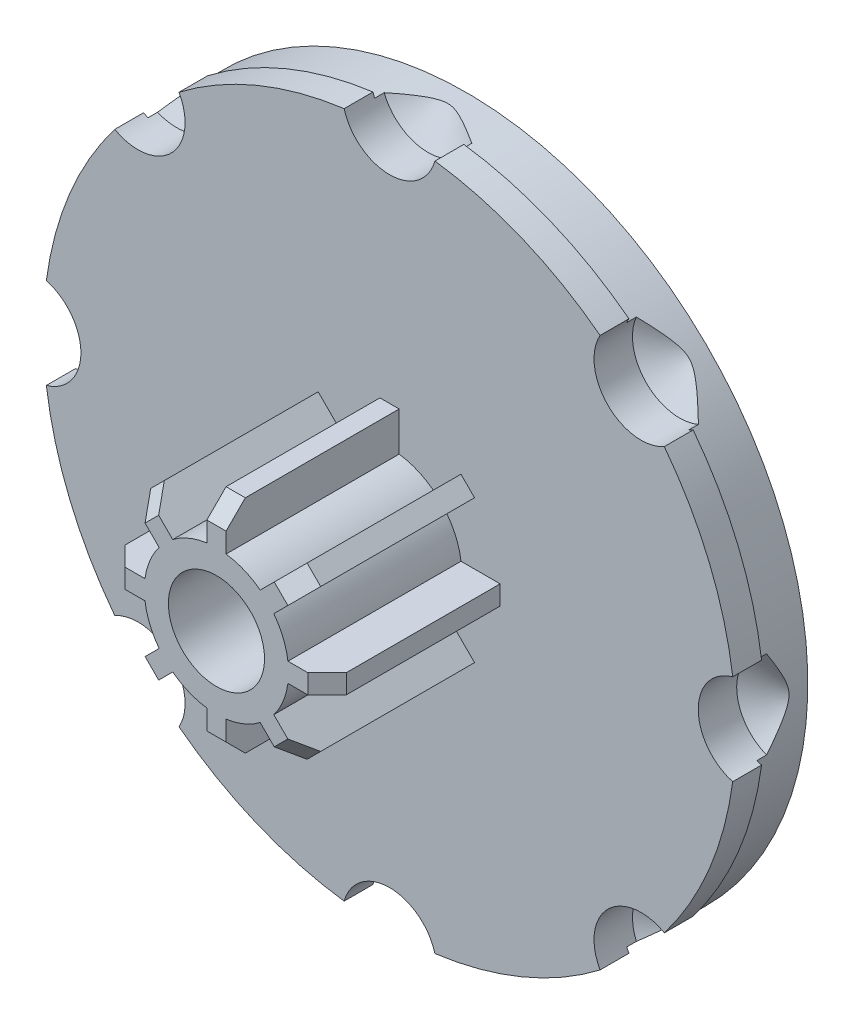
from build123d import *

# Parameters (mm, degrees)
SKETCH1_R          = 18
EXTRUDE1_DEPTH     = 4
SKETCH2_R          = 3.75
EXTRUDE2_DEPTH     = 9
CIRPATTERN1_COUNT  = 8
EXTRUDE5_START     = -9
EXTRUDE5_DEPTH     = 9
CHAMFER1_SIZE      = 1
SKETCH3_R          = 2.5
EXTRUDE6_DEPTH     = 29.583212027
SKETCH7_OUTSIDE_W  = 48.51
SKETCH7_OUTSIDE_H  = 48.51
SKETCH7_OUTSIDE_R  = 17.75
CUT_EXTRUDE1_DEPTH = 2.5


with BuildPart() as part:
    # Sketch1 → Extrude1 (new body)
    with BuildSketch(Plane.XY):
        Circle(SKETCH1_R)
    extrude(amount=EXTRUDE1_DEPTH)

    # Sketch2 → Extrude2 (add)
    with BuildSketch(Plane.XY.offset(4)):
        Circle(SKETCH2_R)
    extrude(amount=EXTRUDE2_DEPTH)

    # Sketch5 → 4.9 _4.9_ Diameter Hole1 (revolve, cut)
    with BuildSketch(Plane(origin=(0, 18.5, 4), x_dir=(0, -1, 0), z_dir=(1, 0, 0))):
        Polygon((0, 0), (0, 3.472108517), (2.45, 2), (2.45, 0), align=None)
    f_4_9_4_9_diameter_hole1 = revolve(axis=Axis((0, 18.5, 10.35), (0, 0, -1)), mode=Mode.SUBTRACT)

    # CirPattern1: 4.9 _4.9_ Diameter Hole1 ×8 about axis
    cirpattern1_axis = Axis((0, 0, 0), (0, 0, 1))
    for i in range(1, CIRPATTERN1_COUNT):
        add(f_4_9_4_9_diameter_hole1.rotate(cirpattern1_axis, i * 360 / CIRPATTERN1_COUNT), mode=Mode.SUBTRACT)

    # Sketch6 → Extrude5 (add)
    with BuildSketch(Plane.XY.offset(13).offset(EXTRUDE5_START)):
        with BuildLine():
            Line((2.274421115, 2.981527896), (3.712310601, 4.419417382))
            Line((3.712310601, 4.419417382), (4.419417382, 3.712310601))
            Line((4.419417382, 3.712310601), (2.981527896, 2.274421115))
            ThreePointArc((2.981527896, 2.274421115), (3.464548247, 1.435062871), (3.716517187, 0.5))
            Line((3.716517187, 0.5), (5.75, 0.5))
            Line((5.75, 0.5), (5.75, -0.5))
            Line((5.75, -0.5), (3.716517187, -0.5))
            ThreePointArc((3.716517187, -0.5), (3.464548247, -1.435062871), (2.981527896, -2.274421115))
            Line((2.981527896, -2.274421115), (4.419417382, -3.712310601))
            Line((4.419417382, -3.712310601), (3.712310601, -4.419417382))
            Line((3.712310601, -4.419417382), (2.274421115, -2.981527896))
            ThreePointArc((2.274421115, -2.981527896), (1.435062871, -3.464548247), (0.5, -3.716517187))
            Line((0.5, -3.716517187), (0.5, -5.75))
            Line((0.5, -5.75), (-0.5, -5.75))
            Line((-0.5, -5.75), (-0.5, -3.716517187))
            ThreePointArc((-0.5, -3.716517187), (-1.435062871, -3.464548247), (-2.274421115, -2.981527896))
            Line((-2.274421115, -2.981527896), (-3.712310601, -4.419417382))
            Line((-3.712310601, -4.419417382), (-4.419417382, -3.712310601))
            Line((-4.419417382, -3.712310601), (-2.981527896, -2.274421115))
            ThreePointArc((-2.981527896, -2.274421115), (-3.464548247, -1.435062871), (-3.716517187, -0.5))
            Line((-3.716517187, -0.5), (-5.75, -0.5))
            Line((-5.75, -0.5), (-5.75, 0.5))
            Line((-5.75, 0.5), (-3.716517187, 0.5))
            ThreePointArc((-3.716517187, 0.5), (-3.464548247, 1.435062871), (-2.981527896, 2.274421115))
            Line((-2.981527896, 2.274421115), (-4.419417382, 3.712310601))
            Line((-4.419417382, 3.712310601), (-3.712310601, 4.419417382))
            Line((-3.712310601, 4.419417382), (-2.274421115, 2.981527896))
            ThreePointArc((-2.274421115, 2.981527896), (-1.435062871, 3.464548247), (-0.5, 3.716517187))
            Line((-0.5, 3.716517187), (-0.5, 5.75))
            Line((-0.5, 5.75), (0.5, 5.75))
            Line((0.5, 5.75), (0.5, 3.716517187))
            ThreePointArc((0.5, 3.716517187), (1.435062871, 3.464548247), (2.274421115, 2.981527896))
        make_face()
    extrude(amount=EXTRUDE5_DEPTH)

    # Chamfer1
    chamfer1_edges = [part.edges().sort_by_distance(p)[0] for p in [
        (4.065863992, 4.065863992, 13),
        (0, 5.75, 13),
        (-4.065863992, 4.065863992, 13),
        (-5.75, 0, 13),
        (-4.065863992, -4.065863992, 13),
        (0, -5.75, 13),
        (4.065863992, -4.065863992, 13),
        (5.75, 0, 13),
    ]]
    chamfer(chamfer1_edges, length=CHAMFER1_SIZE)

    # Sketch3 → Extrude6 (cut, through all)
    with BuildSketch(Plane.XY.offset(13)):
        Circle(SKETCH3_R)
    extrude(amount=-EXTRUDE6_DEPTH, mode=Mode.SUBTRACT)

    # Sketch7 outside → Cut-Extrude1 (cut)
    with BuildSketch(Plane(origin=(0, 0, 0), x_dir=(-1, 0, 0), z_dir=(0, 0, -1))):
        Rectangle(SKETCH7_OUTSIDE_W, SKETCH7_OUTSIDE_H)
        Circle(SKETCH7_OUTSIDE_R, mode=Mode.SUBTRACT)
    extrude(amount=-CUT_EXTRUDE1_DEPTH, mode=Mode.SUBTRACT)


solid = part.part
